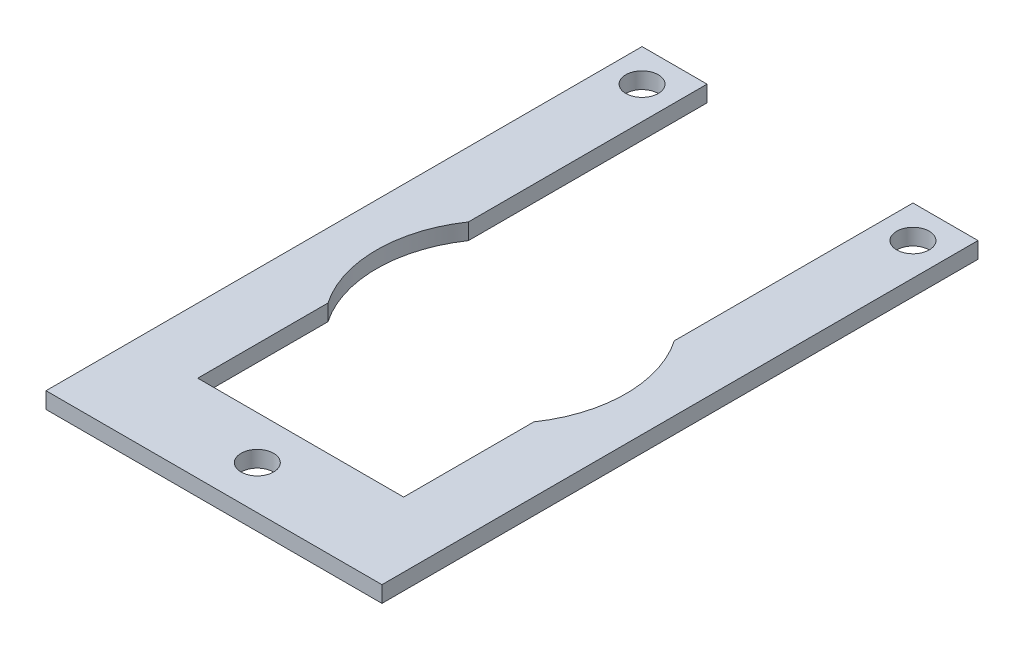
ISO-10303-21;
HEADER;
FILE_DESCRIPTION(('STEP AP214'),'2;1');
FILE_NAME('part.step','',(''),(''),'','','');
FILE_SCHEMA(('AUTOMOTIVE_DESIGN { 1 0 10303 214 1 1 1 1 }'));
ENDSEC;
DATA;
#1=APPLICATION_CONTEXT('core data for automotive mechanical design processes');
#2=APPLICATION_PROTOCOL_DEFINITION('international standard','automotive_design',2000,#1);
#3=PRODUCT_CONTEXT('',#1,'mechanical');
#4=PRODUCT('Part','Part','',(#3));
#5=PRODUCT_RELATED_PRODUCT_CATEGORY('part','',(#4));
#6=PRODUCT_DEFINITION_FORMATION('','',#4);
#7=PRODUCT_DEFINITION_CONTEXT('part definition',#1,'design');
#8=PRODUCT_DEFINITION('design','',#6,#7);
#9=PRODUCT_DEFINITION_SHAPE('','',#8);
#10=(LENGTH_UNIT() NAMED_UNIT(*) SI_UNIT(.MILLI.,.METRE.));
#11=(NAMED_UNIT(*) PLANE_ANGLE_UNIT() SI_UNIT($,.RADIAN.));
#12=(NAMED_UNIT(*) SI_UNIT($,.STERADIAN.) SOLID_ANGLE_UNIT());
#13=UNCERTAINTY_MEASURE_WITH_UNIT(LENGTH_MEASURE(1.E-05),#10,'distance_accuracy_value','');
#14=(GEOMETRIC_REPRESENTATION_CONTEXT(3) GLOBAL_UNCERTAINTY_ASSIGNED_CONTEXT((#13)) GLOBAL_UNIT_ASSIGNED_CONTEXT((#10,
#11,#12)) REPRESENTATION_CONTEXT('',''));
#15=CARTESIAN_POINT('',(0.,0.,0.));
#16=DIRECTION('',(0.,0.,1.));
#17=DIRECTION('',(1.,0.,0.));
#18=AXIS2_PLACEMENT_3D('',#15,#16,#17);
#19=CARTESIAN_POINT('',(31.,3.,-53.));
#20=DIRECTION('',(0.,1.,0.));
#21=DIRECTION('',(0.,0.,1.));
#22=AXIS2_PLACEMENT_3D('',#19,#20,#21);
#23=PLANE('',#22);
#24=CARTESIAN_POINT('',(56.,3.,-104.));
#25=DIRECTION('',(0.,1.,0.));
#26=DIRECTION('',(0.,0.,1.));
#27=AXIS2_PLACEMENT_3D('',#24,#25,#26);
#28=CIRCLE('',#27,3.);
#29=CARTESIAN_POINT('',(56.,3.,-101.));
#30=VERTEX_POINT('',#29);
#31=EDGE_CURVE('E299',#30,#30,#28,.T.);
#32=ORIENTED_EDGE('',*,*,#31,.F.);
#33=EDGE_LOOP('',(#32));
#34=FACE_BOUND('',#33,.T.);
#35=DIRECTION('',(0.,0.,1.));
#36=VECTOR('',#35,1.);
#37=CARTESIAN_POINT('',(0.,3.,0.));
#38=LINE('',#37,#36);
#39=CARTESIAN_POINT('',(0.,3.,-110.));
#40=VERTEX_POINT('',#39);
#41=CARTESIAN_POINT('',(0.,3.,0.));
#42=VERTEX_POINT('',#41);
#43=EDGE_CURVE('E164',#40,#42,#38,.T.);
#44=ORIENTED_EDGE('',*,*,#43,.T.);
#45=DIRECTION('',(1.,0.,0.));
#46=VECTOR('',#45,1.);
#47=CARTESIAN_POINT('',(0.,3.,0.));
#48=LINE('',#47,#46);
#49=CARTESIAN_POINT('',(62.,3.,0.));
#50=VERTEX_POINT('',#49);
#51=EDGE_CURVE('E133',#42,#50,#48,.T.);
#52=ORIENTED_EDGE('',*,*,#51,.T.);
#53=DIRECTION('',(0.,0.,-1.));
#54=VECTOR('',#53,1.);
#55=CARTESIAN_POINT('',(62.,3.,0.));
#56=LINE('',#55,#54);
#57=CARTESIAN_POINT('',(62.,3.,-110.));
#58=VERTEX_POINT('',#57);
#59=EDGE_CURVE('E167',#50,#58,#56,.T.);
#60=ORIENTED_EDGE('',*,*,#59,.T.);
#61=DIRECTION('',(-1.,0.,0.));
#62=VECTOR('',#61,1.);
#63=CARTESIAN_POINT('',(50.,3.,-110.));
#64=LINE('',#63,#62);
#65=CARTESIAN_POINT('',(50.,3.,-110.));
#66=VERTEX_POINT('',#65);
#67=EDGE_CURVE('E169',#58,#66,#64,.T.);
#68=ORIENTED_EDGE('',*,*,#67,.T.);
#69=DIRECTION('',(0.,0.,1.));
#70=VECTOR('',#69,1.);
#71=CARTESIAN_POINT('',(50.,3.,-65.9614813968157));
#72=LINE('',#71,#70);
#73=CARTESIAN_POINT('',(50.,3.,-65.9614813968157));
#74=VERTEX_POINT('',#73);
#75=EDGE_CURVE('E171',#66,#74,#72,.T.);
#76=ORIENTED_EDGE('',*,*,#75,.T.);
#77=CARTESIAN_POINT('',(31.,3.,-53.));
#78=DIRECTION('',(0.,-1.,0.));
#79=DIRECTION('',(0.,0.,1.));
#80=AXIS2_PLACEMENT_3D('',#77,#78,#79);
#81=CIRCLE('',#80,23.);
#82=CARTESIAN_POINT('',(50.,3.,-40.0385186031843));
#83=VERTEX_POINT('',#82);
#84=EDGE_CURVE('E173',#74,#83,#81,.T.);
#85=ORIENTED_EDGE('',*,*,#84,.T.);
#86=DIRECTION('',(0.,0.,1.));
#87=VECTOR('',#86,1.);
#88=CARTESIAN_POINT('',(50.,3.,-16.));
#89=LINE('',#88,#87);
#90=CARTESIAN_POINT('',(50.,3.,-16.));
#91=VERTEX_POINT('',#90);
#92=EDGE_CURVE('E175',#83,#91,#89,.T.);
#93=ORIENTED_EDGE('',*,*,#92,.T.);
#94=DIRECTION('',(-1.,0.,0.));
#95=VECTOR('',#94,1.);
#96=CARTESIAN_POINT('',(12.,3.,-16.));
#97=LINE('',#96,#95);
#98=CARTESIAN_POINT('',(12.,3.,-16.));
#99=VERTEX_POINT('',#98);
#100=EDGE_CURVE('E177',#91,#99,#97,.T.);
#101=ORIENTED_EDGE('',*,*,#100,.T.);
#102=DIRECTION('',(0.,0.,-1.));
#103=VECTOR('',#102,1.);
#104=CARTESIAN_POINT('',(12.,3.,-16.));
#105=LINE('',#104,#103);
#106=CARTESIAN_POINT('',(12.,3.,-40.0385186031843));
#107=VERTEX_POINT('',#106);
#108=EDGE_CURVE('E179',#99,#107,#105,.T.);
#109=ORIENTED_EDGE('',*,*,#108,.T.);
#110=CARTESIAN_POINT('',(31.,3.,-53.));
#111=DIRECTION('',(0.,-1.,0.));
#112=DIRECTION('',(0.,0.,1.));
#113=AXIS2_PLACEMENT_3D('',#110,#111,#112);
#114=CIRCLE('',#113,23.);
#115=CARTESIAN_POINT('',(12.,3.,-65.9614813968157));
#116=VERTEX_POINT('',#115);
#117=EDGE_CURVE('E181',#107,#116,#114,.T.);
#118=ORIENTED_EDGE('',*,*,#117,.T.);
#119=DIRECTION('',(0.,0.,-1.));
#120=VECTOR('',#119,1.);
#121=CARTESIAN_POINT('',(12.,3.,-65.9614813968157));
#122=LINE('',#121,#120);
#123=CARTESIAN_POINT('',(12.,3.,-110.));
#124=VERTEX_POINT('',#123);
#125=EDGE_CURVE('E50',#116,#124,#122,.T.);
#126=ORIENTED_EDGE('',*,*,#125,.T.);
#127=DIRECTION('',(-1.,0.,0.));
#128=VECTOR('',#127,1.);
#129=CARTESIAN_POINT('',(0.,3.,-110.));
#130=LINE('',#129,#128);
#131=EDGE_CURVE('E45',#124,#40,#130,.T.);
#132=ORIENTED_EDGE('',*,*,#131,.T.);
#133=EDGE_LOOP('',(#44,#52,#60,#68,#76,#85,#93,#101,#109,#118,#126,#132));
#134=FACE_BOUND('',#133,.T.);
#135=CARTESIAN_POINT('',(6.,3.,-104.));
#136=DIRECTION('',(0.,1.,0.));
#137=DIRECTION('',(0.,0.,1.));
#138=AXIS2_PLACEMENT_3D('',#135,#136,#137);
#139=CIRCLE('',#138,3.);
#140=CARTESIAN_POINT('',(6.,3.,-101.));
#141=VERTEX_POINT('',#140);
#142=EDGE_CURVE('E138',#141,#141,#139,.T.);
#143=ORIENTED_EDGE('',*,*,#142,.F.);
#144=EDGE_LOOP('',(#143));
#145=FACE_BOUND('',#144,.T.);
#146=CARTESIAN_POINT('',(31.,3.,-8.));
#147=DIRECTION('',(0.,1.,0.));
#148=DIRECTION('',(0.,0.,1.));
#149=AXIS2_PLACEMENT_3D('',#146,#147,#148);
#150=CIRCLE('',#149,3.);
#151=CARTESIAN_POINT('',(31.,3.,-5.));
#152=VERTEX_POINT('',#151);
#153=EDGE_CURVE('E288',#152,#152,#150,.T.);
#154=ORIENTED_EDGE('',*,*,#153,.F.);
#155=EDGE_LOOP('',(#154));
#156=FACE_BOUND('',#155,.T.);
#157=ADVANCED_FACE('F30',(#34,#134,#145,#156),#23,.T.);
#158=CARTESIAN_POINT('',(31.,0.,-53.));
#159=DIRECTION('',(0.,1.,0.));
#160=DIRECTION('',(0.,0.,1.));
#161=AXIS2_PLACEMENT_3D('',#158,#159,#160);
#162=PLANE('',#161);
#163=CARTESIAN_POINT('',(56.,0.,-104.));
#164=DIRECTION('',(0.,1.,0.));
#165=DIRECTION('',(0.,0.,1.));
#166=AXIS2_PLACEMENT_3D('',#163,#164,#165);
#167=CIRCLE('',#166,3.);
#168=CARTESIAN_POINT('',(56.,0.,-101.));
#169=VERTEX_POINT('',#168);
#170=EDGE_CURVE('E294',#169,#169,#167,.T.);
#171=ORIENTED_EDGE('',*,*,#170,.T.);
#172=EDGE_LOOP('',(#171));
#173=FACE_BOUND('',#172,.T.);
#174=DIRECTION('',(0.,0.,1.));
#175=VECTOR('',#174,1.);
#176=CARTESIAN_POINT('',(0.,0.,0.));
#177=LINE('',#176,#175);
#178=CARTESIAN_POINT('',(0.,0.,-110.));
#179=VERTEX_POINT('',#178);
#180=CARTESIAN_POINT('',(0.,0.,0.));
#181=VERTEX_POINT('',#180);
#182=EDGE_CURVE('E124',#179,#181,#177,.T.);
#183=ORIENTED_EDGE('',*,*,#182,.F.);
#184=DIRECTION('',(-1.,0.,0.));
#185=VECTOR('',#184,1.);
#186=CARTESIAN_POINT('',(0.,0.,-110.));
#187=LINE('',#186,#185);
#188=CARTESIAN_POINT('',(12.,0.,-110.));
#189=VERTEX_POINT('',#188);
#190=EDGE_CURVE('E162',#189,#179,#187,.T.);
#191=ORIENTED_EDGE('',*,*,#190,.F.);
#192=DIRECTION('',(0.,0.,-1.));
#193=VECTOR('',#192,1.);
#194=CARTESIAN_POINT('',(12.,0.,-65.9614813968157));
#195=LINE('',#194,#193);
#196=CARTESIAN_POINT('',(12.,0.,-65.9614813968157));
#197=VERTEX_POINT('',#196);
#198=EDGE_CURVE('E160',#197,#189,#195,.T.);
#199=ORIENTED_EDGE('',*,*,#198,.F.);
#200=CARTESIAN_POINT('',(31.,0.,-53.));
#201=DIRECTION('',(0.,-1.,0.));
#202=DIRECTION('',(0.,0.,1.));
#203=AXIS2_PLACEMENT_3D('',#200,#201,#202);
#204=CIRCLE('',#203,23.);
#205=CARTESIAN_POINT('',(12.,0.,-40.0385186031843));
#206=VERTEX_POINT('',#205);
#207=EDGE_CURVE('E158',#206,#197,#204,.T.);
#208=ORIENTED_EDGE('',*,*,#207,.F.);
#209=DIRECTION('',(0.,0.,-1.));
#210=VECTOR('',#209,1.);
#211=CARTESIAN_POINT('',(12.,0.,-16.));
#212=LINE('',#211,#210);
#213=CARTESIAN_POINT('',(12.,0.,-16.));
#214=VERTEX_POINT('',#213);
#215=EDGE_CURVE('E156',#214,#206,#212,.T.);
#216=ORIENTED_EDGE('',*,*,#215,.F.);
#217=DIRECTION('',(-1.,0.,0.));
#218=VECTOR('',#217,1.);
#219=CARTESIAN_POINT('',(12.,0.,-16.));
#220=LINE('',#219,#218);
#221=CARTESIAN_POINT('',(50.,0.,-16.));
#222=VERTEX_POINT('',#221);
#223=EDGE_CURVE('E154',#222,#214,#220,.T.);
#224=ORIENTED_EDGE('',*,*,#223,.F.);
#225=DIRECTION('',(0.,0.,1.));
#226=VECTOR('',#225,1.);
#227=CARTESIAN_POINT('',(50.,0.,-16.));
#228=LINE('',#227,#226);
#229=CARTESIAN_POINT('',(50.,0.,-40.0385186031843));
#230=VERTEX_POINT('',#229);
#231=EDGE_CURVE('E152',#230,#222,#228,.T.);
#232=ORIENTED_EDGE('',*,*,#231,.F.);
#233=CARTESIAN_POINT('',(31.,0.,-53.));
#234=DIRECTION('',(0.,-1.,0.));
#235=DIRECTION('',(0.,0.,1.));
#236=AXIS2_PLACEMENT_3D('',#233,#234,#235);
#237=CIRCLE('',#236,23.);
#238=CARTESIAN_POINT('',(50.,0.,-65.9614813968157));
#239=VERTEX_POINT('',#238);
#240=EDGE_CURVE('E150',#239,#230,#237,.T.);
#241=ORIENTED_EDGE('',*,*,#240,.F.);
#242=DIRECTION('',(0.,0.,1.));
#243=VECTOR('',#242,1.);
#244=CARTESIAN_POINT('',(50.,0.,-65.9614813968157));
#245=LINE('',#244,#243);
#246=CARTESIAN_POINT('',(50.,0.,-110.));
#247=VERTEX_POINT('',#246);
#248=EDGE_CURVE('E148',#247,#239,#245,.T.);
#249=ORIENTED_EDGE('',*,*,#248,.F.);
#250=DIRECTION('',(-1.,0.,0.));
#251=VECTOR('',#250,1.);
#252=CARTESIAN_POINT('',(50.,0.,-110.));
#253=LINE('',#252,#251);
#254=CARTESIAN_POINT('',(62.,0.,-110.));
#255=VERTEX_POINT('',#254);
#256=EDGE_CURVE('E146',#255,#247,#253,.T.);
#257=ORIENTED_EDGE('',*,*,#256,.F.);
#258=DIRECTION('',(0.,0.,-1.));
#259=VECTOR('',#258,1.);
#260=CARTESIAN_POINT('',(62.,0.,0.));
#261=LINE('',#260,#259);
#262=CARTESIAN_POINT('',(62.,0.,0.));
#263=VERTEX_POINT('',#262);
#264=EDGE_CURVE('E126',#263,#255,#261,.T.);
#265=ORIENTED_EDGE('',*,*,#264,.F.);
#266=DIRECTION('',(1.,0.,0.));
#267=VECTOR('',#266,1.);
#268=CARTESIAN_POINT('',(0.,0.,0.));
#269=LINE('',#268,#267);
#270=EDGE_CURVE('E119',#181,#263,#269,.T.);
#271=ORIENTED_EDGE('',*,*,#270,.F.);
#272=EDGE_LOOP('',(#183,#191,#199,#208,#216,#224,#232,#241,#249,#257,#265,#271));
#273=FACE_BOUND('',#272,.T.);
#274=CARTESIAN_POINT('',(6.,0.,-104.));
#275=DIRECTION('',(0.,1.,0.));
#276=DIRECTION('',(0.,0.,1.));
#277=AXIS2_PLACEMENT_3D('',#274,#275,#276);
#278=CIRCLE('',#277,3.);
#279=CARTESIAN_POINT('',(6.,0.,-101.));
#280=VERTEX_POINT('',#279);
#281=EDGE_CURVE('E141',#280,#280,#278,.T.);
#282=ORIENTED_EDGE('',*,*,#281,.T.);
#283=EDGE_LOOP('',(#282));
#284=FACE_BOUND('',#283,.T.);
#285=CARTESIAN_POINT('',(31.,0.,-8.));
#286=DIRECTION('',(0.,1.,0.));
#287=DIRECTION('',(0.,0.,1.));
#288=AXIS2_PLACEMENT_3D('',#285,#286,#287);
#289=CIRCLE('',#288,3.);
#290=CARTESIAN_POINT('',(31.,0.,-5.));
#291=VERTEX_POINT('',#290);
#292=EDGE_CURVE('E291',#291,#291,#289,.T.);
#293=ORIENTED_EDGE('',*,*,#292,.T.);
#294=EDGE_LOOP('',(#293));
#295=FACE_BOUND('',#294,.T.);
#296=ADVANCED_FACE('F120',(#173,#273,#284,#295),#162,.F.);
#297=CARTESIAN_POINT('',(0.,3.,0.));
#298=DIRECTION('',(1.,0.,0.));
#299=DIRECTION('',(0.,0.,-1.));
#300=AXIS2_PLACEMENT_3D('',#297,#298,#299);
#301=PLANE('',#300);
#302=ORIENTED_EDGE('',*,*,#182,.T.);
#303=DIRECTION('',(0.,-1.,0.));
#304=VECTOR('',#303,1.);
#305=CARTESIAN_POINT('',(0.,3.,0.));
#306=LINE('',#305,#304);
#307=EDGE_CURVE('E11',#42,#181,#306,.T.);
#308=ORIENTED_EDGE('',*,*,#307,.F.);
#309=ORIENTED_EDGE('',*,*,#43,.F.);
#310=DIRECTION('',(0.,-1.,0.));
#311=VECTOR('',#310,1.);
#312=CARTESIAN_POINT('',(0.,3.,-110.));
#313=LINE('',#312,#311);
#314=EDGE_CURVE('E137',#40,#179,#313,.T.);
#315=ORIENTED_EDGE('',*,*,#314,.T.);
#316=EDGE_LOOP('',(#302,#308,#309,#315));
#317=FACE_BOUND('',#316,.T.);
#318=ADVANCED_FACE('F32',(#317),#301,.F.);
#319=CARTESIAN_POINT('',(0.,3.,0.));
#320=DIRECTION('',(0.,0.,-1.));
#321=DIRECTION('',(-1.,0.,0.));
#322=AXIS2_PLACEMENT_3D('',#319,#320,#321);
#323=PLANE('',#322);
#324=ORIENTED_EDGE('',*,*,#270,.T.);
#325=DIRECTION('',(0.,-1.,0.));
#326=VECTOR('',#325,1.);
#327=CARTESIAN_POINT('',(62.,3.,0.));
#328=LINE('',#327,#326);
#329=EDGE_CURVE('E38',#50,#263,#328,.T.);
#330=ORIENTED_EDGE('',*,*,#329,.F.);
#331=ORIENTED_EDGE('',*,*,#51,.F.);
#332=ORIENTED_EDGE('',*,*,#307,.T.);
#333=EDGE_LOOP('',(#324,#330,#331,#332));
#334=FACE_BOUND('',#333,.T.);
#335=ADVANCED_FACE('F132',(#334),#323,.F.);
#336=CARTESIAN_POINT('',(62.,3.,0.));
#337=DIRECTION('',(-1.,0.,0.));
#338=DIRECTION('',(0.,0.,1.));
#339=AXIS2_PLACEMENT_3D('',#336,#337,#338);
#340=PLANE('',#339);
#341=ORIENTED_EDGE('',*,*,#264,.T.);
#342=DIRECTION('',(0.,-1.,0.));
#343=VECTOR('',#342,1.);
#344=CARTESIAN_POINT('',(62.,3.,-110.));
#345=LINE('',#344,#343);
#346=EDGE_CURVE('E210',#58,#255,#345,.T.);
#347=ORIENTED_EDGE('',*,*,#346,.F.);
#348=ORIENTED_EDGE('',*,*,#59,.F.);
#349=ORIENTED_EDGE('',*,*,#329,.T.);
#350=EDGE_LOOP('',(#341,#347,#348,#349));
#351=FACE_BOUND('',#350,.T.);
#352=ADVANCED_FACE('F214',(#351),#340,.F.);
#353=CARTESIAN_POINT('',(50.,3.,-110.));
#354=DIRECTION('',(0.,0.,1.));
#355=DIRECTION('',(1.,0.,0.));
#356=AXIS2_PLACEMENT_3D('',#353,#354,#355);
#357=PLANE('',#356);
#358=ORIENTED_EDGE('',*,*,#256,.T.);
#359=DIRECTION('',(0.,-1.,0.));
#360=VECTOR('',#359,1.);
#361=CARTESIAN_POINT('',(50.,3.,-110.));
#362=LINE('',#361,#360);
#363=EDGE_CURVE('E207',#66,#247,#362,.T.);
#364=ORIENTED_EDGE('',*,*,#363,.F.);
#365=ORIENTED_EDGE('',*,*,#67,.F.);
#366=ORIENTED_EDGE('',*,*,#346,.T.);
#367=EDGE_LOOP('',(#358,#364,#365,#366));
#368=FACE_BOUND('',#367,.T.);
#369=ADVANCED_FACE('F222',(#368),#357,.F.);
#370=CARTESIAN_POINT('',(50.,3.,-65.9614813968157));
#371=DIRECTION('',(1.,0.,0.));
#372=DIRECTION('',(0.,0.,-1.));
#373=AXIS2_PLACEMENT_3D('',#370,#371,#372);
#374=PLANE('',#373);
#375=ORIENTED_EDGE('',*,*,#248,.T.);
#376=DIRECTION('',(0.,-1.,0.));
#377=VECTOR('',#376,1.);
#378=CARTESIAN_POINT('',(50.,3.,-65.9614813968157));
#379=LINE('',#378,#377);
#380=EDGE_CURVE('E204',#74,#239,#379,.T.);
#381=ORIENTED_EDGE('',*,*,#380,.F.);
#382=ORIENTED_EDGE('',*,*,#75,.F.);
#383=ORIENTED_EDGE('',*,*,#363,.T.);
#384=EDGE_LOOP('',(#375,#381,#382,#383));
#385=FACE_BOUND('',#384,.T.);
#386=ADVANCED_FACE('F225',(#385),#374,.F.);
#387=CARTESIAN_POINT('',(31.,3.,-53.));
#388=DIRECTION('',(0.,-1.,0.));
#389=DIRECTION('',(0.,0.,-1.));
#390=AXIS2_PLACEMENT_3D('',#387,#388,#389);
#391=CYLINDRICAL_SURFACE('',#390,23.);
#392=ORIENTED_EDGE('',*,*,#240,.T.);
#393=DIRECTION('',(0.,-1.,0.));
#394=VECTOR('',#393,1.);
#395=CARTESIAN_POINT('',(50.,3.,-40.0385186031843));
#396=LINE('',#395,#394);
#397=EDGE_CURVE('E201',#83,#230,#396,.T.);
#398=ORIENTED_EDGE('',*,*,#397,.F.);
#399=ORIENTED_EDGE('',*,*,#84,.F.);
#400=ORIENTED_EDGE('',*,*,#380,.T.);
#401=EDGE_LOOP('',(#392,#398,#399,#400));
#402=FACE_BOUND('',#401,.T.);
#403=ADVANCED_FACE('F230',(#402),#391,.F.);
#404=CARTESIAN_POINT('',(50.,3.,-16.));
#405=DIRECTION('',(1.,0.,0.));
#406=DIRECTION('',(0.,0.,-1.));
#407=AXIS2_PLACEMENT_3D('',#404,#405,#406);
#408=PLANE('',#407);
#409=ORIENTED_EDGE('',*,*,#231,.T.);
#410=DIRECTION('',(0.,-1.,0.));
#411=VECTOR('',#410,1.);
#412=CARTESIAN_POINT('',(50.,3.,-16.));
#413=LINE('',#412,#411);
#414=EDGE_CURVE('E198',#91,#222,#413,.T.);
#415=ORIENTED_EDGE('',*,*,#414,.F.);
#416=ORIENTED_EDGE('',*,*,#92,.F.);
#417=ORIENTED_EDGE('',*,*,#397,.T.);
#418=EDGE_LOOP('',(#409,#415,#416,#417));
#419=FACE_BOUND('',#418,.T.);
#420=ADVANCED_FACE('F236',(#419),#408,.F.);
#421=CARTESIAN_POINT('',(12.,3.,-16.));
#422=DIRECTION('',(0.,0.,1.));
#423=DIRECTION('',(1.,0.,0.));
#424=AXIS2_PLACEMENT_3D('',#421,#422,#423);
#425=PLANE('',#424);
#426=ORIENTED_EDGE('',*,*,#223,.T.);
#427=DIRECTION('',(0.,-1.,0.));
#428=VECTOR('',#427,1.);
#429=CARTESIAN_POINT('',(12.,3.,-16.));
#430=LINE('',#429,#428);
#431=EDGE_CURVE('E195',#99,#214,#430,.T.);
#432=ORIENTED_EDGE('',*,*,#431,.F.);
#433=ORIENTED_EDGE('',*,*,#100,.F.);
#434=ORIENTED_EDGE('',*,*,#414,.T.);
#435=EDGE_LOOP('',(#426,#432,#433,#434));
#436=FACE_BOUND('',#435,.T.);
#437=ADVANCED_FACE('F240',(#436),#425,.F.);
#438=CARTESIAN_POINT('',(12.,3.,-16.));
#439=DIRECTION('',(-1.,0.,0.));
#440=DIRECTION('',(0.,0.,1.));
#441=AXIS2_PLACEMENT_3D('',#438,#439,#440);
#442=PLANE('',#441);
#443=ORIENTED_EDGE('',*,*,#215,.T.);
#444=DIRECTION('',(0.,-1.,0.));
#445=VECTOR('',#444,1.);
#446=CARTESIAN_POINT('',(12.,3.,-40.0385186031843));
#447=LINE('',#446,#445);
#448=EDGE_CURVE('E192',#107,#206,#447,.T.);
#449=ORIENTED_EDGE('',*,*,#448,.F.);
#450=ORIENTED_EDGE('',*,*,#108,.F.);
#451=ORIENTED_EDGE('',*,*,#431,.T.);
#452=EDGE_LOOP('',(#443,#449,#450,#451));
#453=FACE_BOUND('',#452,.T.);
#454=ADVANCED_FACE('F245',(#453),#442,.F.);
#455=CARTESIAN_POINT('',(31.,3.,-53.));
#456=DIRECTION('',(0.,-1.,0.));
#457=DIRECTION('',(0.,0.,-1.));
#458=AXIS2_PLACEMENT_3D('',#455,#456,#457);
#459=CYLINDRICAL_SURFACE('',#458,23.);
#460=ORIENTED_EDGE('',*,*,#207,.T.);
#461=DIRECTION('',(0.,-1.,0.));
#462=VECTOR('',#461,1.);
#463=CARTESIAN_POINT('',(12.,3.,-65.9614813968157));
#464=LINE('',#463,#462);
#465=EDGE_CURVE('E189',#116,#197,#464,.T.);
#466=ORIENTED_EDGE('',*,*,#465,.F.);
#467=ORIENTED_EDGE('',*,*,#117,.F.);
#468=ORIENTED_EDGE('',*,*,#448,.T.);
#469=EDGE_LOOP('',(#460,#466,#467,#468));
#470=FACE_BOUND('',#469,.T.);
#471=ADVANCED_FACE('F249',(#470),#459,.F.);
#472=CARTESIAN_POINT('',(12.,3.,-65.9614813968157));
#473=DIRECTION('',(-1.,0.,0.));
#474=DIRECTION('',(0.,0.,1.));
#475=AXIS2_PLACEMENT_3D('',#472,#473,#474);
#476=PLANE('',#475);
#477=ORIENTED_EDGE('',*,*,#198,.T.);
#478=DIRECTION('',(0.,-1.,0.));
#479=VECTOR('',#478,1.);
#480=CARTESIAN_POINT('',(12.,3.,-110.));
#481=LINE('',#480,#479);
#482=EDGE_CURVE('E186',#124,#189,#481,.T.);
#483=ORIENTED_EDGE('',*,*,#482,.F.);
#484=ORIENTED_EDGE('',*,*,#125,.F.);
#485=ORIENTED_EDGE('',*,*,#465,.T.);
#486=EDGE_LOOP('',(#477,#483,#484,#485));
#487=FACE_BOUND('',#486,.T.);
#488=ADVANCED_FACE('F253',(#487),#476,.F.);
#489=CARTESIAN_POINT('',(0.,3.,-110.));
#490=DIRECTION('',(0.,0.,1.));
#491=DIRECTION('',(1.,0.,0.));
#492=AXIS2_PLACEMENT_3D('',#489,#490,#491);
#493=PLANE('',#492);
#494=ORIENTED_EDGE('',*,*,#190,.T.);
#495=ORIENTED_EDGE('',*,*,#314,.F.);
#496=ORIENTED_EDGE('',*,*,#131,.F.);
#497=ORIENTED_EDGE('',*,*,#482,.T.);
#498=EDGE_LOOP('',(#494,#495,#496,#497));
#499=FACE_BOUND('',#498,.T.);
#500=ADVANCED_FACE('F255',(#499),#493,.F.);
#501=CARTESIAN_POINT('',(6.,3.,-104.));
#502=DIRECTION('',(0.,-1.,0.));
#503=DIRECTION('',(0.,0.,-1.));
#504=AXIS2_PLACEMENT_3D('',#501,#502,#503);
#505=CYLINDRICAL_SURFACE('',#504,3.);
#506=ORIENTED_EDGE('',*,*,#142,.T.);
#507=EDGE_LOOP('',(#506));
#508=FACE_BOUND('',#507,.T.);
#509=ORIENTED_EDGE('',*,*,#281,.F.);
#510=EDGE_LOOP('',(#509));
#511=FACE_BOUND('',#510,.T.);
#512=ADVANCED_FACE('F257',(#508,#511),#505,.F.);
#513=CARTESIAN_POINT('',(56.,3.,-104.));
#514=DIRECTION('',(0.,-1.,0.));
#515=DIRECTION('',(0.,0.,-1.));
#516=AXIS2_PLACEMENT_3D('',#513,#514,#515);
#517=CYLINDRICAL_SURFACE('',#516,3.);
#518=ORIENTED_EDGE('',*,*,#31,.T.);
#519=EDGE_LOOP('',(#518));
#520=FACE_BOUND('',#519,.T.);
#521=ORIENTED_EDGE('',*,*,#170,.F.);
#522=EDGE_LOOP('',(#521));
#523=FACE_BOUND('',#522,.T.);
#524=ADVANCED_FACE('F263',(#520,#523),#517,.F.);
#525=CARTESIAN_POINT('',(31.,3.,-8.));
#526=DIRECTION('',(0.,-1.,0.));
#527=DIRECTION('',(0.,0.,-1.));
#528=AXIS2_PLACEMENT_3D('',#525,#526,#527);
#529=CYLINDRICAL_SURFACE('',#528,3.);
#530=ORIENTED_EDGE('',*,*,#153,.T.);
#531=EDGE_LOOP('',(#530));
#532=FACE_BOUND('',#531,.T.);
#533=ORIENTED_EDGE('',*,*,#292,.F.);
#534=EDGE_LOOP('',(#533));
#535=FACE_BOUND('',#534,.T.);
#536=ADVANCED_FACE('F279',(#532,#535),#529,.F.);
#537=CLOSED_SHELL('',(#157,#296,#318,#335,#352,#369,#386,#403,#420,#437,#454,#471,#488,#500,
#512,#524,#536));
#538=MANIFOLD_SOLID_BREP('B2',#537);
#539=ADVANCED_BREP_SHAPE_REPRESENTATION('',(#18,#538),#14);
#540=SHAPE_DEFINITION_REPRESENTATION(#9,#539);
ENDSEC;
END-ISO-10303-21;
